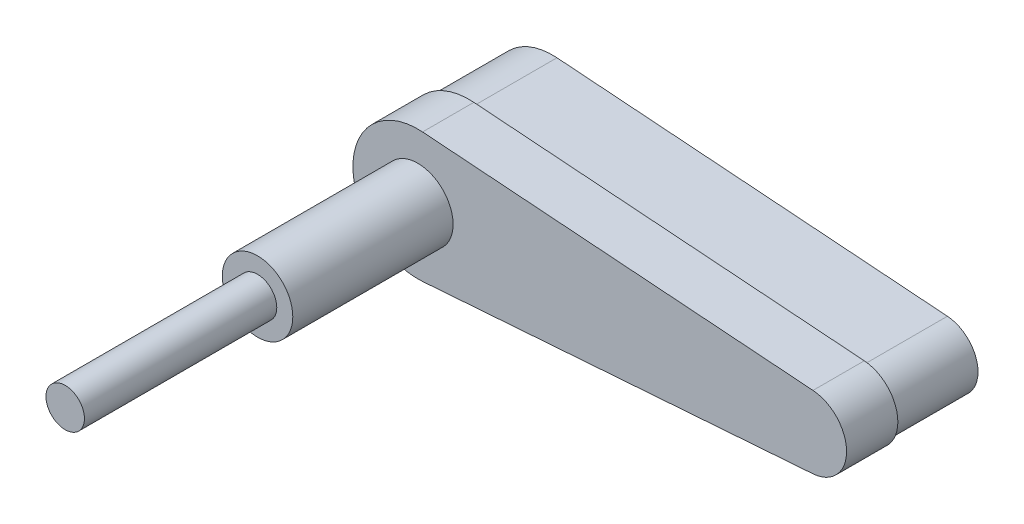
from build123d import *

# Parameters (mm, degrees)
BOSS_EXTRU_1_DEPTH      = 13
BOSS_EXTRU_2_DEPTH      = 8
ESQUISSE4_R             = 5.5
BOSS_EXTRU_3_DEPTH      = 55
ENL_V_START             = -30
ESQUISSE5_R             = 5.5
ESQUISSE5_R_2           = 3
ENL_V_MAT_EXTRU_1_DEPTH = 30


with BuildPart() as part:
    # Esquisse1 → Boss.-Extru.1 (new body)
    with BuildSketch(Plane.XY):
        with BuildLine():
            Line((10.329521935, 9.6), (71.2270063, 5.135702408))
            ThreePointArc((71.2270063, 5.135702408), (76, 0), (71.2270063, -5.135702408))
            Line((71.2270063, -5.135702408), (10.329521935, -9.6))
            ThreePointArc((10.329521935, -9.6), (0, 0), (10.329521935, 9.6))
        make_face()
    extrude(amount=BOSS_EXTRU_1_DEPTH)

    # Esquisse3 → Boss.-Extru.2 (add)
    with BuildSketch(Plane.XY.offset(13)):
        with BuildLine():
            Line((71.263562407, 5.634364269), (10.366078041, 10.09866186))
            ThreePointArc((10.366078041, 10.09866186), (-0.5, 0), (10.366078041, -10.09866186))
            Line((10.366078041, -10.09866186), (71.263562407, -5.634364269))
            ThreePointArc((71.263562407, -5.634364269), (76.5, 0), (71.263562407, 5.634364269))
        make_face()
    extrude(amount=BOSS_EXTRU_2_DEPTH)

    # Esquisse4 → Boss.-Extru.3 (add)
    with BuildSketch(Plane.XY.offset(21)):
        with Locations((9.625761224, 0)):
            Circle(ESQUISSE4_R)
    extrude(amount=BOSS_EXTRU_3_DEPTH)

    # Esquisse5 → Enl_v. mat.-Extru.1 (cut)
    with BuildSketch(Plane.XY.offset(76).offset(ENL_V_START)):
        with Locations((9.625761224, 0)):
            Circle(ESQUISSE5_R)
        with Locations((9.625761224, 0)):
            Circle(ESQUISSE5_R_2, mode=Mode.SUBTRACT)
    extrude(amount=ENL_V_MAT_EXTRU_1_DEPTH, mode=Mode.SUBTRACT)


solid = part.part
